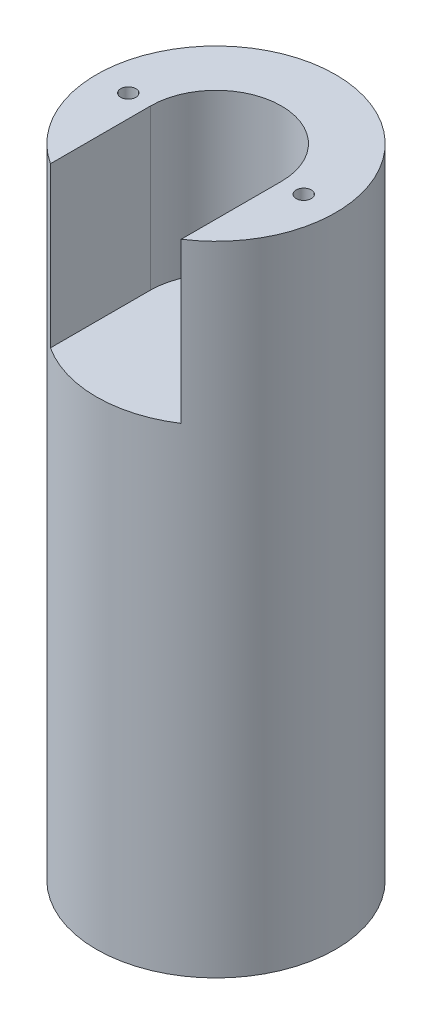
ISO-10303-21;
HEADER;
FILE_DESCRIPTION(('STEP AP214'),'2;1');
FILE_NAME('part.step','',(''),(''),'','','');
FILE_SCHEMA(('AUTOMOTIVE_DESIGN { 1 0 10303 214 1 1 1 1 }'));
ENDSEC;
DATA;
#1=APPLICATION_CONTEXT('core data for automotive mechanical design processes');
#2=APPLICATION_PROTOCOL_DEFINITION('international standard','automotive_design',2000,#1);
#3=PRODUCT_CONTEXT('',#1,'mechanical');
#4=PRODUCT('Part','Part','',(#3));
#5=PRODUCT_RELATED_PRODUCT_CATEGORY('part','',(#4));
#6=PRODUCT_DEFINITION_FORMATION('','',#4);
#7=PRODUCT_DEFINITION_CONTEXT('part definition',#1,'design');
#8=PRODUCT_DEFINITION('design','',#6,#7);
#9=PRODUCT_DEFINITION_SHAPE('','',#8);
#10=(LENGTH_UNIT() NAMED_UNIT(*) SI_UNIT(.MILLI.,.METRE.));
#11=(NAMED_UNIT(*) PLANE_ANGLE_UNIT() SI_UNIT($,.RADIAN.));
#12=(NAMED_UNIT(*) SI_UNIT($,.STERADIAN.) SOLID_ANGLE_UNIT());
#13=UNCERTAINTY_MEASURE_WITH_UNIT(LENGTH_MEASURE(1.E-05),#10,'distance_accuracy_value','');
#14=(GEOMETRIC_REPRESENTATION_CONTEXT(3) GLOBAL_UNCERTAINTY_ASSIGNED_CONTEXT((#13)) GLOBAL_UNIT_ASSIGNED_CONTEXT((#10,
#11,#12)) REPRESENTATION_CONTEXT('',''));
#15=CARTESIAN_POINT('',(0.,0.,0.));
#16=DIRECTION('',(0.,0.,1.));
#17=DIRECTION('',(1.,0.,0.));
#18=AXIS2_PLACEMENT_3D('',#15,#16,#17);
#19=CARTESIAN_POINT('',(-5.5,36.3499999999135,0.));
#20=DIRECTION('',(0.,1.,0.));
#21=DIRECTION('',(0.,0.,1.));
#22=AXIS2_PLACEMENT_3D('',#19,#20,#21);
#23=CONICAL_SURFACE('',#22,0.474999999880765,1.02974425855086);
#24=CARTESIAN_POINT('',(-5.5,36.0645912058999,0.));
#25=VERTEX_POINT('',#24);
#26=VERTEX_LOOP('',#25);
#27=FACE_BOUND('',#26,.T.);
#28=CARTESIAN_POINT('',(-5.5,36.35,0.));
#29=DIRECTION('',(0.,1.,0.));
#30=DIRECTION('',(0.,0.,1.));
#31=AXIS2_PLACEMENT_3D('',#28,#29,#30);
#32=CIRCLE('',#31,0.474999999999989);
#33=CARTESIAN_POINT('',(-5.5,36.35,0.474999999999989));
#34=VERTEX_POINT('',#33);
#35=EDGE_CURVE('E75',#34,#34,#32,.T.);
#36=ORIENTED_EDGE('',*,*,#35,.T.);
#37=EDGE_LOOP('',(#36));
#38=FACE_BOUND('',#37,.T.);
#39=ADVANCED_FACE('F17',(#27,#38),#23,.F.);
#40=CARTESIAN_POINT('',(5.5,36.3499999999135,0.));
#41=DIRECTION('',(0.,1.,0.));
#42=DIRECTION('',(0.,0.,1.));
#43=AXIS2_PLACEMENT_3D('',#40,#41,#42);
#44=CONICAL_SURFACE('',#43,0.474999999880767,1.02974425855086);
#45=CARTESIAN_POINT('',(5.5,36.0645912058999,0.));
#46=VERTEX_POINT('',#45);
#47=VERTEX_LOOP('',#46);
#48=FACE_BOUND('',#47,.T.);
#49=CARTESIAN_POINT('',(5.5,36.35,0.));
#50=DIRECTION('',(0.,1.,0.));
#51=DIRECTION('',(0.,0.,1.));
#52=AXIS2_PLACEMENT_3D('',#49,#50,#51);
#53=CIRCLE('',#52,0.474999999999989);
#54=CARTESIAN_POINT('',(5.5,36.35,0.474999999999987));
#55=VERTEX_POINT('',#54);
#56=EDGE_CURVE('E77',#55,#55,#53,.T.);
#57=ORIENTED_EDGE('',*,*,#56,.T.);
#58=EDGE_LOOP('',(#57));
#59=FACE_BOUND('',#58,.T.);
#60=ADVANCED_FACE('F72',(#48,#59),#44,.F.);
#61=CARTESIAN_POINT('',(0.,21.000000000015,0.));
#62=DIRECTION('',(0.,-1.,0.));
#63=DIRECTION('',(0.,0.,-1.));
#64=AXIS2_PLACEMENT_3D('',#61,#62,#63);
#65=CONICAL_SURFACE('',#64,3.49999999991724,1.02974425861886);
#66=CARTESIAN_POINT('',(0.,23.103012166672,2.8421709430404E-11));
#67=VERTEX_POINT('',#66);
#68=VERTEX_LOOP('',#67);
#69=FACE_BOUND('',#68,.T.);
#70=CARTESIAN_POINT('',(0.,21.,0.));
#71=DIRECTION('',(0.,-1.,0.));
#72=DIRECTION('',(0.,0.,-1.));
#73=AXIS2_PLACEMENT_3D('',#70,#71,#72);
#74=CIRCLE('',#73,3.49999999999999);
#75=CARTESIAN_POINT('',(0.,21.,-3.49999999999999));
#76=VERTEX_POINT('',#75);
#77=EDGE_CURVE('E115',#76,#76,#74,.T.);
#78=ORIENTED_EDGE('',*,*,#77,.T.);
#79=EDGE_LOOP('',(#78));
#80=FACE_BOUND('',#79,.T.);
#81=ADVANCED_FACE('F121',(#69,#80),#65,.F.);
#82=CARTESIAN_POINT('',(-5.5,40.,0.));
#83=DIRECTION('',(0.,1.,0.));
#84=DIRECTION('',(0.,0.,1.));
#85=AXIS2_PLACEMENT_3D('',#82,#83,#84);
#86=CYLINDRICAL_SURFACE('',#85,0.474999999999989);
#87=CARTESIAN_POINT('',(-5.5,40.,0.));
#88=DIRECTION('',(0.,1.,0.));
#89=DIRECTION('',(0.,0.,1.));
#90=AXIS2_PLACEMENT_3D('',#87,#88,#89);
#91=CIRCLE('',#90,0.474999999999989);
#92=CARTESIAN_POINT('',(-5.5,40.,0.474999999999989));
#93=VERTEX_POINT('',#92);
#94=EDGE_CURVE('E98',#93,#93,#91,.F.);
#95=ORIENTED_EDGE('',*,*,#94,.F.);
#96=EDGE_LOOP('',(#95));
#97=FACE_BOUND('',#96,.T.);
#98=ORIENTED_EDGE('',*,*,#35,.F.);
#99=EDGE_LOOP('',(#98));
#100=FACE_BOUND('',#99,.T.);
#101=ADVANCED_FACE('F162',(#97,#100),#86,.F.);
#102=CARTESIAN_POINT('',(5.5,40.,0.));
#103=DIRECTION('',(0.,1.,0.));
#104=DIRECTION('',(0.,0.,1.));
#105=AXIS2_PLACEMENT_3D('',#102,#103,#104);
#106=CYLINDRICAL_SURFACE('',#105,0.474999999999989);
#107=CARTESIAN_POINT('',(5.5,40.,0.));
#108=DIRECTION('',(0.,1.,0.));
#109=DIRECTION('',(0.,0.,1.));
#110=AXIS2_PLACEMENT_3D('',#107,#108,#109);
#111=CIRCLE('',#110,0.474999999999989);
#112=CARTESIAN_POINT('',(5.5,40.,0.474999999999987));
#113=VERTEX_POINT('',#112);
#114=EDGE_CURVE('E95',#113,#113,#111,.F.);
#115=ORIENTED_EDGE('',*,*,#114,.F.);
#116=EDGE_LOOP('',(#115));
#117=FACE_BOUND('',#116,.T.);
#118=ORIENTED_EDGE('',*,*,#56,.F.);
#119=EDGE_LOOP('',(#118));
#120=FACE_BOUND('',#119,.T.);
#121=ADVANCED_FACE('F158',(#117,#120),#106,.F.);
#122=CARTESIAN_POINT('',(0.,30.,0.));
#123=DIRECTION('',(0.,1.,0.));
#124=DIRECTION('',(0.,0.,1.));
#125=AXIS2_PLACEMENT_3D('',#122,#123,#124);
#126=CYLINDRICAL_SURFACE('',#125,4.1);
#127=DIRECTION('',(0.,1.,0.));
#128=VECTOR('',#127,1.);
#129=CARTESIAN_POINT('',(-4.1,30.,0.));
#130=LINE('',#129,#128);
#131=CARTESIAN_POINT('',(-4.1,40.,0.));
#132=VERTEX_POINT('',#131);
#133=CARTESIAN_POINT('',(-4.1,30.,0.));
#134=VERTEX_POINT('',#133);
#135=EDGE_CURVE('E103',#132,#134,#130,.F.);
#136=ORIENTED_EDGE('',*,*,#135,.T.);
#137=CARTESIAN_POINT('',(0.,30.,0.));
#138=DIRECTION('',(0.,1.,0.));
#139=DIRECTION('',(0.,0.,1.));
#140=AXIS2_PLACEMENT_3D('',#137,#138,#139);
#141=CIRCLE('',#140,4.1);
#142=CARTESIAN_POINT('',(4.1,30.,0.));
#143=VERTEX_POINT('',#142);
#144=EDGE_CURVE('E20',#143,#134,#141,.T.);
#145=ORIENTED_EDGE('',*,*,#144,.F.);
#146=DIRECTION('',(0.,1.,0.));
#147=VECTOR('',#146,1.);
#148=CARTESIAN_POINT('',(4.1,30.,0.));
#149=LINE('',#148,#147);
#150=CARTESIAN_POINT('',(4.1,40.,0.));
#151=VERTEX_POINT('',#150);
#152=EDGE_CURVE('E59',#143,#151,#149,.T.);
#153=ORIENTED_EDGE('',*,*,#152,.T.);
#154=CARTESIAN_POINT('',(0.,40.,0.));
#155=DIRECTION('',(0.,1.,0.));
#156=DIRECTION('',(0.,0.,1.));
#157=AXIS2_PLACEMENT_3D('',#154,#155,#156);
#158=CIRCLE('',#157,4.1);
#159=EDGE_CURVE('E92',#132,#151,#158,.F.);
#160=ORIENTED_EDGE('',*,*,#159,.F.);
#161=EDGE_LOOP('',(#136,#145,#153,#160));
#162=FACE_BOUND('',#161,.T.);
#163=ADVANCED_FACE('F155',(#162),#126,.F.);
#164=CARTESIAN_POINT('',(4.1,30.,0.));
#165=DIRECTION('',(1.,0.,0.));
#166=DIRECTION('',(0.,0.,-1.));
#167=AXIS2_PLACEMENT_3D('',#164,#165,#166);
#168=PLANE('',#167);
#169=ORIENTED_EDGE('',*,*,#152,.F.);
#170=DIRECTION('',(0.,0.,1.));
#171=VECTOR('',#170,1.);
#172=CARTESIAN_POINT('',(4.1,30.,0.));
#173=LINE('',#172,#171);
#174=CARTESIAN_POINT('',(4.1,30.,6.28012738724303));
#175=VERTEX_POINT('',#174);
#176=EDGE_CURVE('E112',#175,#143,#173,.F.);
#177=ORIENTED_EDGE('',*,*,#176,.F.);
#178=DIRECTION('',(0.,-1.,0.));
#179=VECTOR('',#178,1.);
#180=CARTESIAN_POINT('',(4.1,40.,6.28012738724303));
#181=LINE('',#180,#179);
#182=CARTESIAN_POINT('',(4.1,40.,6.28012738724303));
#183=VERTEX_POINT('',#182);
#184=EDGE_CURVE('E91',#183,#175,#181,.T.);
#185=ORIENTED_EDGE('',*,*,#184,.F.);
#186=DIRECTION('',(0.,0.,1.));
#187=VECTOR('',#186,1.);
#188=CARTESIAN_POINT('',(4.1,40.,0.));
#189=LINE('',#188,#187);
#190=EDGE_CURVE('E97',#151,#183,#189,.T.);
#191=ORIENTED_EDGE('',*,*,#190,.F.);
#192=EDGE_LOOP('',(#169,#177,#185,#191));
#193=FACE_BOUND('',#192,.T.);
#194=ADVANCED_FACE('F127',(#193),#168,.F.);
#195=CARTESIAN_POINT('',(0.,0.,0.));
#196=DIRECTION('',(0.,-1.,0.));
#197=DIRECTION('',(0.,0.,-1.));
#198=AXIS2_PLACEMENT_3D('',#195,#196,#197);
#199=CYLINDRICAL_SURFACE('',#198,3.49999999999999);
#200=ORIENTED_EDGE('',*,*,#77,.F.);
#201=EDGE_LOOP('',(#200));
#202=FACE_BOUND('',#201,.T.);
#203=CARTESIAN_POINT('',(0.,0.,0.));
#204=DIRECTION('',(0.,-1.,0.));
#205=DIRECTION('',(0.,0.,-1.));
#206=AXIS2_PLACEMENT_3D('',#203,#204,#205);
#207=CIRCLE('',#206,3.49999999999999);
#208=CARTESIAN_POINT('',(0.,0.,-3.49999999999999));
#209=VERTEX_POINT('',#208);
#210=EDGE_CURVE('E88',#209,#209,#207,.T.);
#211=ORIENTED_EDGE('',*,*,#210,.T.);
#212=EDGE_LOOP('',(#211));
#213=FACE_BOUND('',#212,.T.);
#214=ADVANCED_FACE('F123',(#202,#213),#199,.F.);
#215=CARTESIAN_POINT('',(0.,30.,0.));
#216=DIRECTION('',(0.,1.,0.));
#217=DIRECTION('',(0.,0.,1.));
#218=AXIS2_PLACEMENT_3D('',#215,#216,#217);
#219=PLANE('',#218);
#220=ORIENTED_EDGE('',*,*,#144,.T.);
#221=DIRECTION('',(0.,0.,1.));
#222=VECTOR('',#221,1.);
#223=CARTESIAN_POINT('',(-4.1,30.,0.));
#224=LINE('',#223,#222);
#225=CARTESIAN_POINT('',(-4.1,30.,6.28012738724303));
#226=VERTEX_POINT('',#225);
#227=EDGE_CURVE('E100',#134,#226,#224,.T.);
#228=ORIENTED_EDGE('',*,*,#227,.T.);
#229=CARTESIAN_POINT('',(0.,30.,0.));
#230=DIRECTION('',(0.,-1.,0.));
#231=DIRECTION('',(0.,0.,-1.));
#232=AXIS2_PLACEMENT_3D('',#229,#230,#231);
#233=CIRCLE('',#232,7.5);
#234=EDGE_CURVE('E85',#175,#226,#233,.T.);
#235=ORIENTED_EDGE('',*,*,#234,.F.);
#236=ORIENTED_EDGE('',*,*,#176,.T.);
#237=EDGE_LOOP('',(#220,#228,#235,#236));
#238=FACE_BOUND('',#237,.T.);
#239=ADVANCED_FACE('F126',(#238),#219,.T.);
#240=CARTESIAN_POINT('',(-4.1,30.,0.));
#241=DIRECTION('',(-1.,0.,0.));
#242=DIRECTION('',(0.,0.,1.));
#243=AXIS2_PLACEMENT_3D('',#240,#241,#242);
#244=PLANE('',#243);
#245=ORIENTED_EDGE('',*,*,#135,.F.);
#246=DIRECTION('',(0.,0.,1.));
#247=VECTOR('',#246,1.);
#248=CARTESIAN_POINT('',(-4.1,40.,0.));
#249=LINE('',#248,#247);
#250=CARTESIAN_POINT('',(-4.1,40.,6.28012738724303));
#251=VERTEX_POINT('',#250);
#252=EDGE_CURVE('E35',#251,#132,#249,.F.);
#253=ORIENTED_EDGE('',*,*,#252,.F.);
#254=DIRECTION('',(0.,-1.,0.));
#255=VECTOR('',#254,1.);
#256=CARTESIAN_POINT('',(-4.1,40.,6.28012738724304));
#257=LINE('',#256,#255);
#258=EDGE_CURVE('E84',#226,#251,#257,.F.);
#259=ORIENTED_EDGE('',*,*,#258,.F.);
#260=ORIENTED_EDGE('',*,*,#227,.F.);
#261=EDGE_LOOP('',(#245,#253,#259,#260));
#262=FACE_BOUND('',#261,.T.);
#263=ADVANCED_FACE('F144',(#262),#244,.F.);
#264=CARTESIAN_POINT('',(0.,40.,0.));
#265=DIRECTION('',(0.,1.,0.));
#266=DIRECTION('',(0.,0.,1.));
#267=AXIS2_PLACEMENT_3D('',#264,#265,#266);
#268=PLANE('',#267);
#269=ORIENTED_EDGE('',*,*,#252,.T.);
#270=ORIENTED_EDGE('',*,*,#159,.T.);
#271=ORIENTED_EDGE('',*,*,#190,.T.);
#272=CARTESIAN_POINT('',(0.,40.,0.));
#273=DIRECTION('',(0.,-1.,0.));
#274=DIRECTION('',(0.,0.,-1.));
#275=AXIS2_PLACEMENT_3D('',#272,#273,#274);
#276=CIRCLE('',#275,7.5);
#277=EDGE_CURVE('E26',#251,#183,#276,.T.);
#278=ORIENTED_EDGE('',*,*,#277,.F.);
#279=EDGE_LOOP('',(#269,#270,#271,#278));
#280=FACE_BOUND('',#279,.T.);
#281=ORIENTED_EDGE('',*,*,#114,.T.);
#282=EDGE_LOOP('',(#281));
#283=FACE_BOUND('',#282,.T.);
#284=ORIENTED_EDGE('',*,*,#94,.T.);
#285=EDGE_LOOP('',(#284));
#286=FACE_BOUND('',#285,.T.);
#287=ADVANCED_FACE('F134',(#280,#283,#286),#268,.T.);
#288=CARTESIAN_POINT('',(0.,0.,0.));
#289=DIRECTION('',(0.,1.,0.));
#290=DIRECTION('',(0.,0.,1.));
#291=AXIS2_PLACEMENT_3D('',#288,#289,#290);
#292=PLANE('',#291);
#293=CARTESIAN_POINT('',(0.,0.,0.));
#294=DIRECTION('',(0.,-1.,0.));
#295=DIRECTION('',(0.,0.,-1.));
#296=AXIS2_PLACEMENT_3D('',#293,#294,#295);
#297=CIRCLE('',#296,7.5);
#298=CARTESIAN_POINT('',(0.,0.,-7.5));
#299=VERTEX_POINT('',#298);
#300=EDGE_CURVE('E11',#299,#299,#297,.F.);
#301=ORIENTED_EDGE('',*,*,#300,.F.);
#302=EDGE_LOOP('',(#301));
#303=FACE_BOUND('',#302,.T.);
#304=ORIENTED_EDGE('',*,*,#210,.F.);
#305=EDGE_LOOP('',(#304));
#306=FACE_BOUND('',#305,.T.);
#307=ADVANCED_FACE('F131',(#303,#306),#292,.F.);
#308=CARTESIAN_POINT('',(0.,40.,0.));
#309=DIRECTION('',(0.,-1.,0.));
#310=DIRECTION('',(0.,0.,-1.));
#311=AXIS2_PLACEMENT_3D('',#308,#309,#310);
#312=CYLINDRICAL_SURFACE('',#311,7.5);
#313=ORIENTED_EDGE('',*,*,#184,.T.);
#314=ORIENTED_EDGE('',*,*,#234,.T.);
#315=ORIENTED_EDGE('',*,*,#258,.T.);
#316=ORIENTED_EDGE('',*,*,#277,.T.);
#317=EDGE_LOOP('',(#313,#314,#315,#316));
#318=FACE_BOUND('',#317,.T.);
#319=ORIENTED_EDGE('',*,*,#300,.T.);
#320=EDGE_LOOP('',(#319));
#321=FACE_BOUND('',#320,.T.);
#322=ADVANCED_FACE('F133',(#318,#321),#312,.T.);
#323=CLOSED_SHELL('',(#39,#60,#81,#101,#121,#163,#194,#214,#239,#263,#287,#307,#322));
#324=MANIFOLD_SOLID_BREP('B1',#323);
#325=ADVANCED_BREP_SHAPE_REPRESENTATION('',(#18,#324),#14);
#326=SHAPE_DEFINITION_REPRESENTATION(#9,#325);
ENDSEC;
END-ISO-10303-21;
